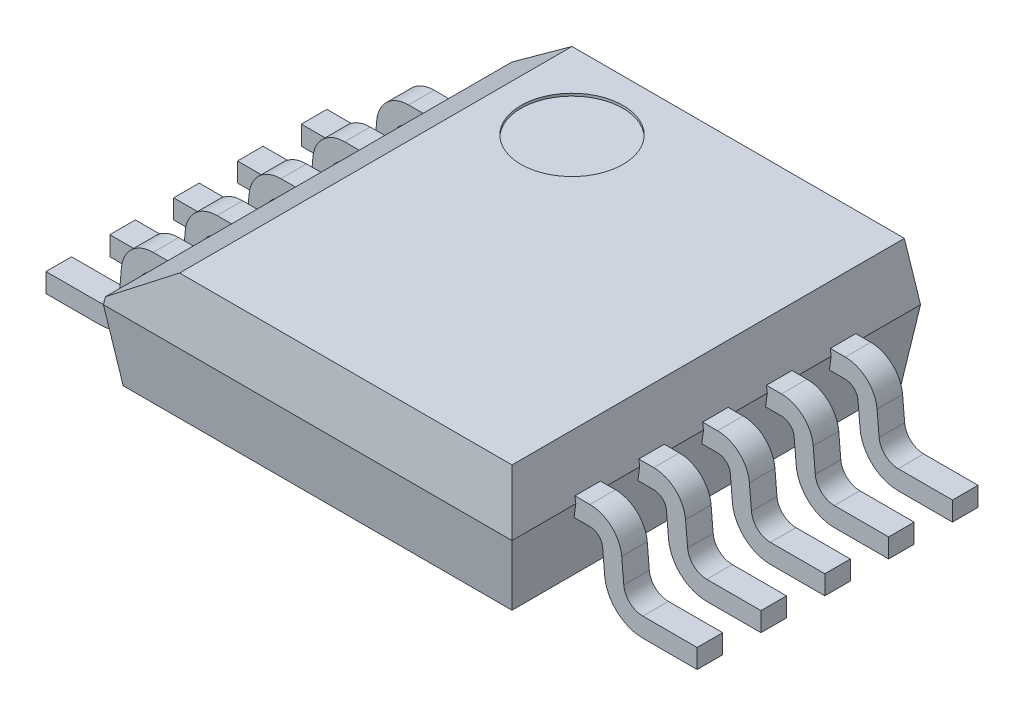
from build123d import *

# Parameters (mm, degrees)
EXTRUDE_1_DEPTH              = 0.1
SKETCH_3429_W                = 3.2
SKETCH_3429_H                = 3.2
EXTRUDE_3487_DEPTH           = 0.45
EXTRUDE_3487_TAPER           = 8
EXTRUDE_3487_OTHER_WAY_DEPTH = 0.55
EXTRUDE_3487_OTHER_WAY_TAPER = 8
PATTERN_LINEAR_3566_COUNT    = 5
PATTERN_LINEAR_3566_PITCH    = 0.5
CHAMFER_1_SIZE               = 0.4
CHAMFER_1_SIZE2              = 0.469982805
SKETCH_3_R                   = 0.4
CUT_EXTRUDE_3_DEPTH          = 0.02
SKTHERMALPAD_W               = 2.5
SKTHERMALPAD_H               = 2.5
THERMALPAD_DEPTH             = 0.65


with BuildPart() as part:
    # Sketch 1 → Extrude 1 (new, symmetric)
    with BuildSketch(Plane.XY.offset(-1)):
        with BuildLine():
            Line((-2.55, 0), (-2.124899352, 0))
            ThreePointArc((-2.124899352, 0), (-1.92222229, 0.078816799), (-1.826040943, 0.273853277))
            Line((-1.826040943, 0.273853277), (-1.809867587, 0.458715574))
            ThreePointArc((-1.809867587, 0.458715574), (-1.777807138, 0.523727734), (-1.710248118, 0.55))
            Line((-1.710248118, 0.55), (1.710248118, 0.55))
            ThreePointArc((1.710248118, 0.55), (1.777807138, 0.523727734), (1.809867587, 0.458715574))
            Line((1.809867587, 0.458715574), (1.826040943, 0.273853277))
            ThreePointArc((1.826040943, 0.273853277), (1.92222229, 0.078816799), (2.124899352, 0))
            Line((2.124899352, 0), (2.55, 0))
            Line((2.55, 0), (2.55, 0.15))
            Line((2.55, 0.15), (2.124899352, 0.15))
            ThreePointArc((2.124899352, 0.15), (2.023560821, 0.189408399), (1.975470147, 0.286926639))
            Line((1.975470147, 0.286926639), (1.959296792, 0.471788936))
            ThreePointArc((1.959296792, 0.471788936), (1.87914567, 0.634319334), (1.710248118, 0.7))
            Line((1.710248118, 0.7), (-1.710248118, 0.7))
            ThreePointArc((-1.710248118, 0.7), (-1.87914567, 0.634319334), (-1.959296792, 0.471788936))
            Line((-1.959296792, 0.471788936), (-1.975470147, 0.286926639))
            ThreePointArc((-1.975470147, 0.286926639), (-2.023560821, 0.189408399), (-2.124899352, 0.15))
            Line((-2.124899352, 0.15), (-2.55, 0.15))
            Line((-2.55, 0.15), (-2.55, 0))
        make_face()
    extrude_1 = extrude(amount=EXTRUDE_1_DEPTH, both=True)

    # Sketch 3429 → Extrude 3487 (add)
    with BuildSketch(Plane(origin=(0, 0.65, 0), x_dir=(1, 0, 0), z_dir=(0, 1, 0))):
        Rectangle(SKETCH_3429_W, SKETCH_3429_H)
    extrude(amount=EXTRUDE_3487_DEPTH, taper=EXTRUDE_3487_TAPER)

    # Sketch 3429 → Extrude 3487 other way (add)
    with BuildSketch(Plane(origin=(0, 0.65, 0), x_dir=(1, 0, 0), z_dir=(0, 1, 0))):
        Rectangle(SKETCH_3429_W, SKETCH_3429_H)
    extrude(amount=-EXTRUDE_3487_OTHER_WAY_DEPTH, taper=EXTRUDE_3487_OTHER_WAY_TAPER)

    # Pattern Linear 3566: Extrude 1 ×5
    with Locations(*[(0, 0, i * PATTERN_LINEAR_3566_PITCH) for i in range(1, PATTERN_LINEAR_3566_COUNT)]):
        add(extrude_1)

    # Chamfer 1
    chamfer_1_edges = [part.edges().sort_by_distance(p)[0] for p in [
        (-1.536756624, 1.1, 0),
    ]]
    chamfer_1_side = [part.faces().sort_by_distance(p)[0] for p in [
        (-1.567566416, 0.880776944, 0),
    ]]
    chamfer(chamfer_1_edges, length=CHAMFER_1_SIZE, length2=CHAMFER_1_SIZE2, reference=chamfer_1_side[0])

    # Sketch 3 → Cut-Extrude 3 (cut)
    with BuildSketch(Plane(origin=(0, 1.1, 0), x_dir=(1, 0, 0), z_dir=(0, 1, 0))):
        with Locations(Location((-0.46677382, 0.936756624, 0), (0, 0, 270))):
            Circle(SKETCH_3_R)
    extrude(amount=-CUT_EXTRUDE_3_DEPTH, mode=Mode.SUBTRACT)

    # SkThermalPad → ThermalPad (add)
    with BuildSketch(Plane(origin=(0, 0.65, 0), x_dir=(-1, 0, 0), z_dir=(0, 1, 0))):
        Rectangle(SKTHERMALPAD_W, SKTHERMALPAD_H)
    extrude(amount=-THERMALPAD_DEPTH)


solid = part.part
